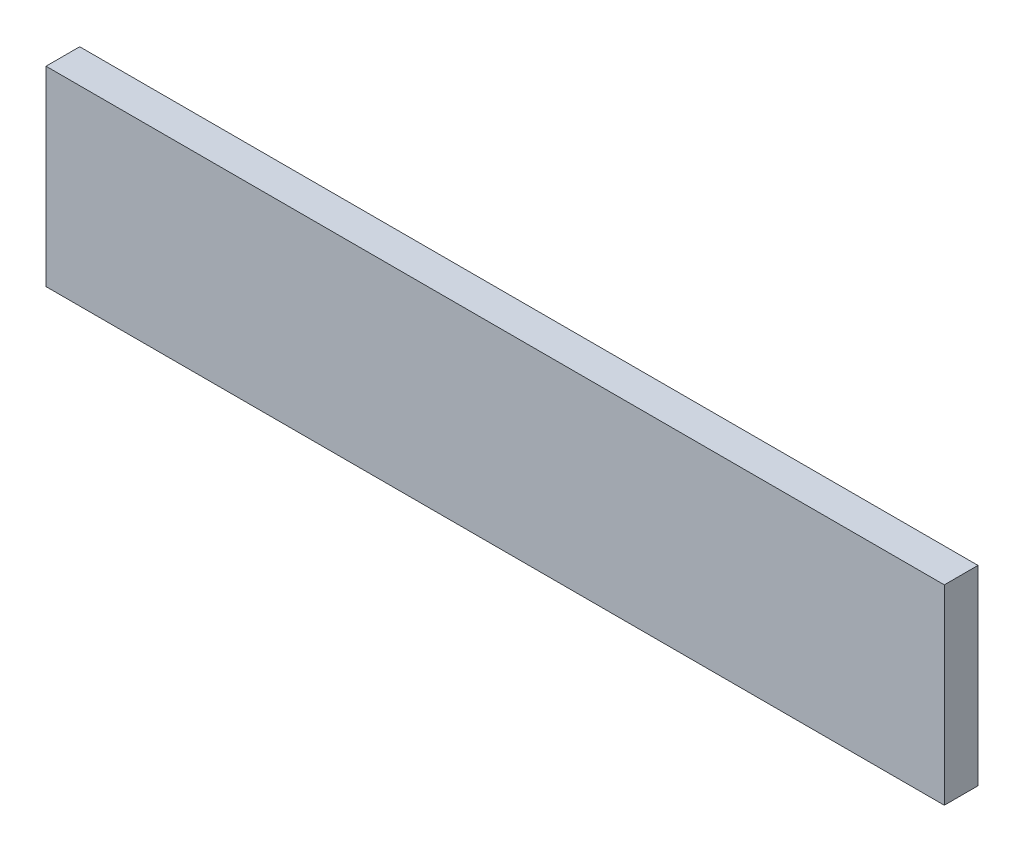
ISO-10303-21;
HEADER;
FILE_DESCRIPTION(('STEP AP214'),'2;1');
FILE_NAME('part.step','',(''),(''),'','','');
FILE_SCHEMA(('AUTOMOTIVE_DESIGN { 1 0 10303 214 1 1 1 1 }'));
ENDSEC;
DATA;
#1=APPLICATION_CONTEXT('core data for automotive mechanical design processes');
#2=APPLICATION_PROTOCOL_DEFINITION('international standard','automotive_design',2000,#1);
#3=PRODUCT_CONTEXT('',#1,'mechanical');
#4=PRODUCT('Part','Part','',(#3));
#5=PRODUCT_RELATED_PRODUCT_CATEGORY('part','',(#4));
#6=PRODUCT_DEFINITION_FORMATION('','',#4);
#7=PRODUCT_DEFINITION_CONTEXT('part definition',#1,'design');
#8=PRODUCT_DEFINITION('design','',#6,#7);
#9=PRODUCT_DEFINITION_SHAPE('','',#8);
#10=(LENGTH_UNIT() NAMED_UNIT(*) SI_UNIT(.MILLI.,.METRE.));
#11=(NAMED_UNIT(*) PLANE_ANGLE_UNIT() SI_UNIT($,.RADIAN.));
#12=(NAMED_UNIT(*) SI_UNIT($,.STERADIAN.) SOLID_ANGLE_UNIT());
#13=UNCERTAINTY_MEASURE_WITH_UNIT(LENGTH_MEASURE(1.E-05),#10,'distance_accuracy_value','');
#14=(GEOMETRIC_REPRESENTATION_CONTEXT(3) GLOBAL_UNCERTAINTY_ASSIGNED_CONTEXT((#13)) GLOBAL_UNIT_ASSIGNED_CONTEXT((#10,
#11,#12)) REPRESENTATION_CONTEXT('',''));
#15=CARTESIAN_POINT('',(0.,0.,0.));
#16=DIRECTION('',(0.,0.,1.));
#17=DIRECTION('',(1.,0.,0.));
#18=AXIS2_PLACEMENT_3D('',#15,#16,#17);
#19=CARTESIAN_POINT('',(200.,42.5,15.));
#20=DIRECTION('',(-1.,0.,0.));
#21=DIRECTION('',(0.,0.,1.));
#22=AXIS2_PLACEMENT_3D('',#19,#20,#21);
#23=PLANE('',#22);
#24=DIRECTION('',(0.,1.,0.));
#25=VECTOR('',#24,1.);
#26=CARTESIAN_POINT('',(200.,42.5,0.));
#27=LINE('',#26,#25);
#28=CARTESIAN_POINT('',(200.,-42.5,0.));
#29=VERTEX_POINT('',#28);
#30=CARTESIAN_POINT('',(200.,42.5,0.));
#31=VERTEX_POINT('',#30);
#32=EDGE_CURVE('E111',#29,#31,#27,.T.);
#33=ORIENTED_EDGE('',*,*,#32,.T.);
#34=DIRECTION('',(0.,0.,-1.));
#35=VECTOR('',#34,1.);
#36=CARTESIAN_POINT('',(200.,42.5,15.));
#37=LINE('',#36,#35);
#38=CARTESIAN_POINT('',(200.,42.5,15.));
#39=VERTEX_POINT('',#38);
#40=EDGE_CURVE('E11',#39,#31,#37,.T.);
#41=ORIENTED_EDGE('',*,*,#40,.F.);
#42=DIRECTION('',(0.,1.,0.));
#43=VECTOR('',#42,1.);
#44=CARTESIAN_POINT('',(200.,42.5,15.));
#45=LINE('',#44,#43);
#46=CARTESIAN_POINT('',(200.,-42.5,15.));
#47=VERTEX_POINT('',#46);
#48=EDGE_CURVE('E95',#47,#39,#45,.T.);
#49=ORIENTED_EDGE('',*,*,#48,.F.);
#50=DIRECTION('',(0.,0.,-1.));
#51=VECTOR('',#50,1.);
#52=CARTESIAN_POINT('',(200.,-42.5,15.));
#53=LINE('',#52,#51);
#54=EDGE_CURVE('E107',#47,#29,#53,.T.);
#55=ORIENTED_EDGE('',*,*,#54,.T.);
#56=EDGE_LOOP('',(#33,#41,#49,#55));
#57=FACE_BOUND('',#56,.T.);
#58=ADVANCED_FACE('F43',(#57),#23,.F.);
#59=CARTESIAN_POINT('',(-200.,42.5,15.));
#60=DIRECTION('',(0.,-1.,0.));
#61=DIRECTION('',(0.,0.,-1.));
#62=AXIS2_PLACEMENT_3D('',#59,#60,#61);
#63=PLANE('',#62);
#64=DIRECTION('',(-1.,0.,0.));
#65=VECTOR('',#64,1.);
#66=CARTESIAN_POINT('',(-200.,42.5,0.));
#67=LINE('',#66,#65);
#68=CARTESIAN_POINT('',(-200.,42.5,0.));
#69=VERTEX_POINT('',#68);
#70=EDGE_CURVE('E100',#31,#69,#67,.T.);
#71=ORIENTED_EDGE('',*,*,#70,.T.);
#72=DIRECTION('',(0.,0.,-1.));
#73=VECTOR('',#72,1.);
#74=CARTESIAN_POINT('',(-200.,42.5,15.));
#75=LINE('',#74,#73);
#76=CARTESIAN_POINT('',(-200.,42.5,15.));
#77=VERTEX_POINT('',#76);
#78=EDGE_CURVE('E52',#77,#69,#75,.T.);
#79=ORIENTED_EDGE('',*,*,#78,.F.);
#80=DIRECTION('',(-1.,0.,0.));
#81=VECTOR('',#80,1.);
#82=CARTESIAN_POINT('',(-200.,42.5,15.));
#83=LINE('',#82,#81);
#84=EDGE_CURVE('E90',#39,#77,#83,.T.);
#85=ORIENTED_EDGE('',*,*,#84,.F.);
#86=ORIENTED_EDGE('',*,*,#40,.T.);
#87=EDGE_LOOP('',(#71,#79,#85,#86));
#88=FACE_BOUND('',#87,.T.);
#89=ADVANCED_FACE('F99',(#88),#63,.F.);
#90=CARTESIAN_POINT('',(-200.,42.5,15.));
#91=DIRECTION('',(1.,0.,0.));
#92=DIRECTION('',(0.,0.,-1.));
#93=AXIS2_PLACEMENT_3D('',#90,#91,#92);
#94=PLANE('',#93);
#95=DIRECTION('',(0.,-1.,0.));
#96=VECTOR('',#95,1.);
#97=CARTESIAN_POINT('',(-200.,42.5,0.));
#98=LINE('',#97,#96);
#99=CARTESIAN_POINT('',(-200.,-42.5,0.));
#100=VERTEX_POINT('',#99);
#101=EDGE_CURVE('E77',#69,#100,#98,.T.);
#102=ORIENTED_EDGE('',*,*,#101,.T.);
#103=DIRECTION('',(0.,0.,-1.));
#104=VECTOR('',#103,1.);
#105=CARTESIAN_POINT('',(-200.,-42.5,15.));
#106=LINE('',#105,#104);
#107=CARTESIAN_POINT('',(-200.,-42.5,15.));
#108=VERTEX_POINT('',#107);
#109=EDGE_CURVE('E102',#108,#100,#106,.T.);
#110=ORIENTED_EDGE('',*,*,#109,.F.);
#111=DIRECTION('',(0.,-1.,0.));
#112=VECTOR('',#111,1.);
#113=CARTESIAN_POINT('',(-200.,42.5,15.));
#114=LINE('',#113,#112);
#115=EDGE_CURVE('E93',#77,#108,#114,.T.);
#116=ORIENTED_EDGE('',*,*,#115,.F.);
#117=ORIENTED_EDGE('',*,*,#78,.T.);
#118=EDGE_LOOP('',(#102,#110,#116,#117));
#119=FACE_BOUND('',#118,.T.);
#120=ADVANCED_FACE('F103',(#119),#94,.F.);
#121=CARTESIAN_POINT('',(-200.,-42.5,15.));
#122=DIRECTION('',(0.,1.,0.));
#123=DIRECTION('',(0.,0.,1.));
#124=AXIS2_PLACEMENT_3D('',#121,#122,#123);
#125=PLANE('',#124);
#126=DIRECTION('',(1.,0.,0.));
#127=VECTOR('',#126,1.);
#128=CARTESIAN_POINT('',(-200.,-42.5,0.));
#129=LINE('',#128,#127);
#130=EDGE_CURVE('E83',#100,#29,#129,.T.);
#131=ORIENTED_EDGE('',*,*,#130,.T.);
#132=ORIENTED_EDGE('',*,*,#54,.F.);
#133=DIRECTION('',(1.,0.,0.));
#134=VECTOR('',#133,1.);
#135=CARTESIAN_POINT('',(-200.,-42.5,15.));
#136=LINE('',#135,#134);
#137=EDGE_CURVE('E60',#108,#47,#136,.T.);
#138=ORIENTED_EDGE('',*,*,#137,.F.);
#139=ORIENTED_EDGE('',*,*,#109,.T.);
#140=EDGE_LOOP('',(#131,#132,#138,#139));
#141=FACE_BOUND('',#140,.T.);
#142=ADVANCED_FACE('F124',(#141),#125,.F.);
#143=CARTESIAN_POINT('',(0.,0.,15.));
#144=DIRECTION('',(0.,0.,1.));
#145=DIRECTION('',(1.,0.,0.));
#146=AXIS2_PLACEMENT_3D('',#143,#144,#145);
#147=PLANE('',#146);
#148=ORIENTED_EDGE('',*,*,#48,.T.);
#149=ORIENTED_EDGE('',*,*,#84,.T.);
#150=ORIENTED_EDGE('',*,*,#115,.T.);
#151=ORIENTED_EDGE('',*,*,#137,.T.);
#152=EDGE_LOOP('',(#148,#149,#150,#151));
#153=FACE_BOUND('',#152,.T.);
#154=ADVANCED_FACE('F91',(#153),#147,.T.);
#155=CARTESIAN_POINT('',(0.,0.,0.));
#156=DIRECTION('',(0.,0.,1.));
#157=DIRECTION('',(1.,0.,0.));
#158=AXIS2_PLACEMENT_3D('',#155,#156,#157);
#159=PLANE('',#158);
#160=ORIENTED_EDGE('',*,*,#32,.F.);
#161=ORIENTED_EDGE('',*,*,#130,.F.);
#162=ORIENTED_EDGE('',*,*,#101,.F.);
#163=ORIENTED_EDGE('',*,*,#70,.F.);
#164=EDGE_LOOP('',(#160,#161,#162,#163));
#165=FACE_BOUND('',#164,.T.);
#166=ADVANCED_FACE('F127',(#165),#159,.F.);
#167=CLOSED_SHELL('',(#58,#89,#120,#142,#154,#166));
#168=MANIFOLD_SOLID_BREP('B2',#167);
#169=ADVANCED_BREP_SHAPE_REPRESENTATION('',(#18,#168),#14);
#170=SHAPE_DEFINITION_REPRESENTATION(#9,#169);
ENDSEC;
END-ISO-10303-21;
